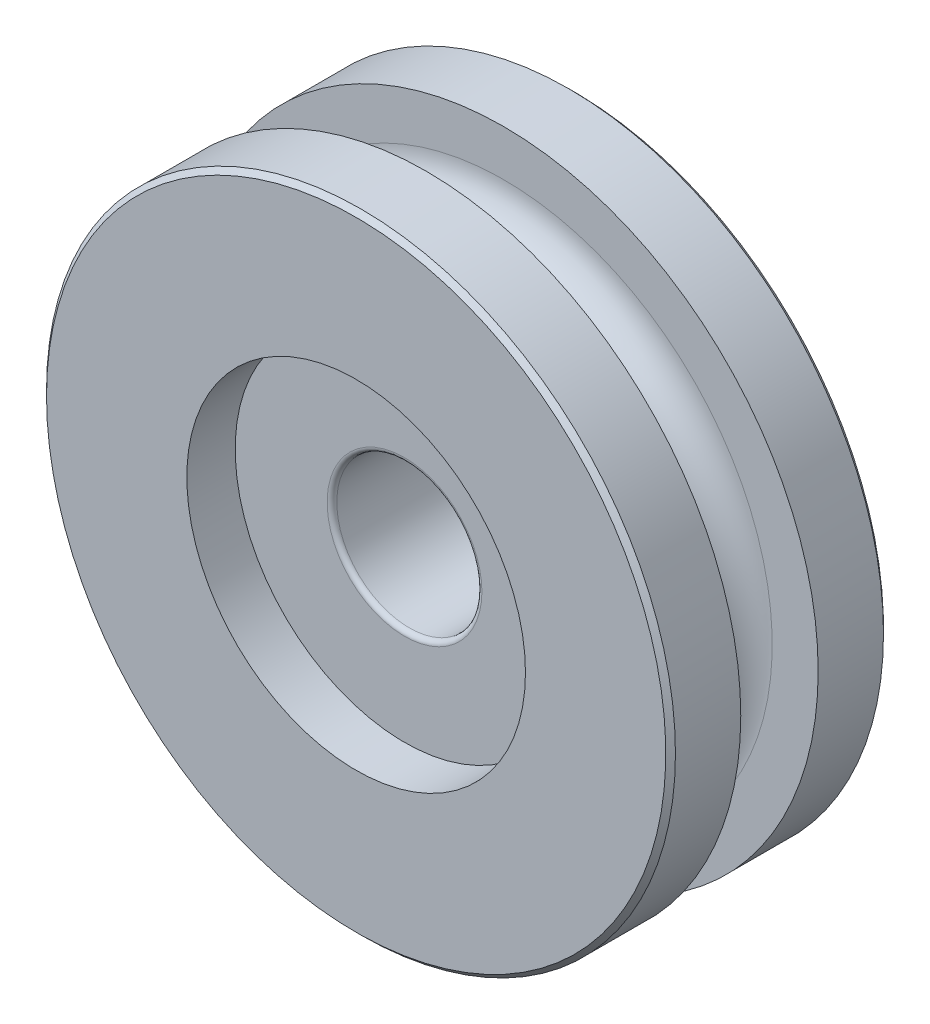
ISO-10303-21;
HEADER;
FILE_DESCRIPTION(('STEP AP214'),'2;1');
FILE_NAME('part.step','',(''),(''),'','','');
FILE_SCHEMA(('AUTOMOTIVE_DESIGN { 1 0 10303 214 1 1 1 1 }'));
ENDSEC;
DATA;
#1=APPLICATION_CONTEXT('core data for automotive mechanical design processes');
#2=APPLICATION_PROTOCOL_DEFINITION('international standard','automotive_design',2000,#1);
#3=PRODUCT_CONTEXT('',#1,'mechanical');
#4=PRODUCT('Part','Part','',(#3));
#5=PRODUCT_RELATED_PRODUCT_CATEGORY('part','',(#4));
#6=PRODUCT_DEFINITION_FORMATION('','',#4);
#7=PRODUCT_DEFINITION_CONTEXT('part definition',#1,'design');
#8=PRODUCT_DEFINITION('design','',#6,#7);
#9=PRODUCT_DEFINITION_SHAPE('','',#8);
#10=(LENGTH_UNIT() NAMED_UNIT(*) SI_UNIT(.MILLI.,.METRE.));
#11=(NAMED_UNIT(*) PLANE_ANGLE_UNIT() SI_UNIT($,.RADIAN.));
#12=(NAMED_UNIT(*) SI_UNIT($,.STERADIAN.) SOLID_ANGLE_UNIT());
#13=UNCERTAINTY_MEASURE_WITH_UNIT(LENGTH_MEASURE(1.E-05),#10,'distance_accuracy_value','');
#14=(GEOMETRIC_REPRESENTATION_CONTEXT(3) GLOBAL_UNCERTAINTY_ASSIGNED_CONTEXT((#13)) GLOBAL_UNIT_ASSIGNED_CONTEXT((#10,
#11,#12)) REPRESENTATION_CONTEXT('',''));
#15=CARTESIAN_POINT('',(0.,0.,0.));
#16=DIRECTION('',(0.,0.,1.));
#17=DIRECTION('',(1.,0.,0.));
#18=AXIS2_PLACEMENT_3D('',#15,#16,#17);
#19=CARTESIAN_POINT('',(0.,3.2,-2.5));
#20=DIRECTION('',(0.,0.,1.));
#21=DIRECTION('',(1.,0.,0.));
#22=AXIS2_PLACEMENT_3D('',#19,#20,#21);
#23=PLANE('',#22);
#24=CARTESIAN_POINT('',(-2.25,-5.66720682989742,-2.5));
#25=DIRECTION('',(0.,0.,-1.));
#26=DIRECTION('',(-1.,0.,0.));
#27=AXIS2_PLACEMENT_3D('',#24,#25,#26);
#28=CIRCLE('',#27,0.85);
#29=CARTESIAN_POINT('',(-3.1,-5.66720682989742,-2.5));
#30=VERTEX_POINT('',#29);
#31=EDGE_CURVE('E181',#30,#30,#28,.T.);
#32=ORIENTED_EDGE('',*,*,#31,.T.);
#33=EDGE_LOOP('',(#32));
#34=FACE_BOUND('',#33,.T.);
#35=ADVANCED_FACE('F14',(#34),#23,.F.);
#36=CARTESIAN_POINT('',(2.25,-5.66720682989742,-2.5));
#37=DIRECTION('',(0.,0.,1.));
#38=DIRECTION('',(-1.,0.,0.));
#39=AXIS2_PLACEMENT_3D('',#36,#37,#38);
#40=CIRCLE('',#39,0.85);
#41=CARTESIAN_POINT('',(1.4,-5.66720682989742,-2.5));
#42=VERTEX_POINT('',#41);
#43=EDGE_CURVE('E121',#42,#42,#40,.T.);
#44=ORIENTED_EDGE('',*,*,#43,.F.);
#45=EDGE_LOOP('',(#44));
#46=FACE_BOUND('',#45,.T.);
#47=ADVANCED_FACE('F268',(#46),#23,.F.);
#48=CARTESIAN_POINT('',(0.,11.1,1.6));
#49=DIRECTION('',(0.,0.,-1.));
#50=DIRECTION('',(-1.,0.,0.));
#51=AXIS2_PLACEMENT_3D('',#48,#49,#50);
#52=PLANE('',#51);
#53=CARTESIAN_POINT('',(0.,0.,1.6));
#54=DIRECTION('',(0.,0.,-1.));
#55=DIRECTION('',(-1.,0.,0.));
#56=AXIS2_PLACEMENT_3D('',#53,#54,#55);
#57=CIRCLE('',#56,13.);
#58=CARTESIAN_POINT('',(-13.,0.,1.6));
#59=VERTEX_POINT('',#58);
#60=EDGE_CURVE('E199',#59,#59,#57,.T.);
#61=ORIENTED_EDGE('',*,*,#60,.T.);
#62=EDGE_LOOP('',(#61));
#63=FACE_BOUND('',#62,.T.);
#64=CARTESIAN_POINT('',(0.,0.,1.6));
#65=DIRECTION('',(0.,0.,-1.));
#66=DIRECTION('',(-1.,0.,0.));
#67=AXIS2_PLACEMENT_3D('',#64,#65,#66);
#68=CIRCLE('',#67,11.1);
#69=CARTESIAN_POINT('',(-11.1,0.,1.6));
#70=VERTEX_POINT('',#69);
#71=EDGE_CURVE('E202',#70,#70,#68,.T.);
#72=ORIENTED_EDGE('',*,*,#71,.F.);
#73=EDGE_LOOP('',(#72));
#74=FACE_BOUND('',#73,.T.);
#75=ADVANCED_FACE('F276',(#63,#74),#52,.T.);
#76=CARTESIAN_POINT('',(0.,0.,-6.27375485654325));
#77=DIRECTION('',(0.,0.,-1.));
#78=DIRECTION('',(-1.,0.,0.));
#79=AXIS2_PLACEMENT_3D('',#76,#77,#78);
#80=CYLINDRICAL_SURFACE('',#79,13.);
#81=CARTESIAN_POINT('',(0.,0.,4.3));
#82=DIRECTION('',(0.,0.,-1.));
#83=DIRECTION('',(-1.,0.,0.));
#84=AXIS2_PLACEMENT_3D('',#81,#82,#83);
#85=CIRCLE('',#84,13.);
#86=CARTESIAN_POINT('',(-13.,0.,4.3));
#87=VERTEX_POINT('',#86);
#88=EDGE_CURVE('E196',#87,#87,#85,.T.);
#89=ORIENTED_EDGE('',*,*,#88,.T.);
#90=EDGE_LOOP('',(#89));
#91=FACE_BOUND('',#90,.T.);
#92=ORIENTED_EDGE('',*,*,#60,.F.);
#93=EDGE_LOOP('',(#92));
#94=FACE_BOUND('',#93,.T.);
#95=ADVANCED_FACE('F326',(#91,#94),#80,.T.);
#96=CARTESIAN_POINT('',(0.,0.,0.));
#97=DIRECTION('',(0.,0.,-1.));
#98=DIRECTION('',(-1.,0.,0.));
#99=AXIS2_PLACEMENT_3D('',#96,#97,#98);
#100=TOROIDAL_SURFACE('',#99,11.1,1.6);
#101=ORIENTED_EDGE('',*,*,#71,.T.);
#102=EDGE_LOOP('',(#101));
#103=FACE_BOUND('',#102,.T.);
#104=CARTESIAN_POINT('',(0.,0.,-1.6));
#105=DIRECTION('',(0.,0.,-1.));
#106=DIRECTION('',(-1.,0.,0.));
#107=AXIS2_PLACEMENT_3D('',#104,#105,#106);
#108=CIRCLE('',#107,11.1);
#109=CARTESIAN_POINT('',(-11.1,0.,-1.6));
#110=VERTEX_POINT('',#109);
#111=EDGE_CURVE('E205',#110,#110,#108,.T.);
#112=ORIENTED_EDGE('',*,*,#111,.F.);
#113=EDGE_LOOP('',(#112));
#114=FACE_BOUND('',#113,.T.);
#115=ADVANCED_FACE('F324',(#103,#114),#100,.F.);
#116=CARTESIAN_POINT('',(0.,0.,4.3));
#117=DIRECTION('',(0.,0.,-1.));
#118=DIRECTION('',(-1.,0.,0.));
#119=AXIS2_PLACEMENT_3D('',#116,#117,#118);
#120=CONICAL_SURFACE('',#119,13.,0.785398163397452);
#121=CARTESIAN_POINT('',(0.,0.,4.5));
#122=DIRECTION('',(0.,0.,-1.));
#123=DIRECTION('',(-1.,0.,0.));
#124=AXIS2_PLACEMENT_3D('',#121,#122,#123);
#125=CIRCLE('',#124,12.8);
#126=CARTESIAN_POINT('',(-12.8,0.,4.5));
#127=VERTEX_POINT('',#126);
#128=EDGE_CURVE('E193',#127,#127,#125,.T.);
#129=ORIENTED_EDGE('',*,*,#128,.T.);
#130=EDGE_LOOP('',(#129));
#131=FACE_BOUND('',#130,.T.);
#132=ORIENTED_EDGE('',*,*,#88,.F.);
#133=EDGE_LOOP('',(#132));
#134=FACE_BOUND('',#133,.T.);
#135=ADVANCED_FACE('F320',(#131,#134),#120,.T.);
#136=CARTESIAN_POINT('',(0.,11.1,-1.6));
#137=DIRECTION('',(0.,0.,1.));
#138=DIRECTION('',(1.,0.,0.));
#139=AXIS2_PLACEMENT_3D('',#136,#137,#138);
#140=PLANE('',#139);
#141=ORIENTED_EDGE('',*,*,#111,.T.);
#142=EDGE_LOOP('',(#141));
#143=FACE_BOUND('',#142,.T.);
#144=CARTESIAN_POINT('',(0.,0.,-1.6));
#145=DIRECTION('',(0.,0.,-1.));
#146=DIRECTION('',(-1.,0.,0.));
#147=AXIS2_PLACEMENT_3D('',#144,#145,#146);
#148=CIRCLE('',#147,13.);
#149=CARTESIAN_POINT('',(-13.,0.,-1.6));
#150=VERTEX_POINT('',#149);
#151=EDGE_CURVE('E208',#150,#150,#148,.T.);
#152=ORIENTED_EDGE('',*,*,#151,.F.);
#153=EDGE_LOOP('',(#152));
#154=FACE_BOUND('',#153,.T.);
#155=ADVANCED_FACE('F323',(#143,#154),#140,.T.);
#156=CARTESIAN_POINT('',(0.,0.,4.5));
#157=DIRECTION('',(0.,0.,1.));
#158=DIRECTION('',(1.,0.,0.));
#159=AXIS2_PLACEMENT_3D('',#156,#157,#158);
#160=PLANE('',#159);
#161=ORIENTED_EDGE('',*,*,#128,.F.);
#162=EDGE_LOOP('',(#161));
#163=FACE_BOUND('',#162,.T.);
#164=CARTESIAN_POINT('',(0.,0.,4.5));
#165=DIRECTION('',(0.,0.,1.));
#166=DIRECTION('',(1.,0.,0.));
#167=AXIS2_PLACEMENT_3D('',#164,#165,#166);
#168=CIRCLE('',#167,7.);
#169=CARTESIAN_POINT('',(7.,0.,4.5));
#170=VERTEX_POINT('',#169);
#171=EDGE_CURVE('E226',#170,#170,#168,.T.);
#172=ORIENTED_EDGE('',*,*,#171,.F.);
#173=EDGE_LOOP('',(#172));
#174=FACE_BOUND('',#173,.T.);
#175=ADVANCED_FACE('F338',(#163,#174),#160,.T.);
#176=CARTESIAN_POINT('',(0.,0.,-6.27375485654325));
#177=DIRECTION('',(0.,0.,-1.));
#178=DIRECTION('',(-1.,0.,0.));
#179=AXIS2_PLACEMENT_3D('',#176,#177,#178);
#180=CYLINDRICAL_SURFACE('',#179,13.);
#181=ORIENTED_EDGE('',*,*,#151,.T.);
#182=EDGE_LOOP('',(#181));
#183=FACE_BOUND('',#182,.T.);
#184=CARTESIAN_POINT('',(0.,0.,-4.3));
#185=DIRECTION('',(0.,0.,-1.));
#186=DIRECTION('',(-1.,0.,0.));
#187=AXIS2_PLACEMENT_3D('',#184,#185,#186);
#188=CIRCLE('',#187,13.);
#189=CARTESIAN_POINT('',(-13.,0.,-4.3));
#190=VERTEX_POINT('',#189);
#191=EDGE_CURVE('E211',#190,#190,#188,.T.);
#192=ORIENTED_EDGE('',*,*,#191,.F.);
#193=EDGE_LOOP('',(#192));
#194=FACE_BOUND('',#193,.T.);
#195=ADVANCED_FACE('F340',(#183,#194),#180,.T.);
#196=CARTESIAN_POINT('',(0.,0.,6.));
#197=DIRECTION('',(0.,0.,1.));
#198=DIRECTION('',(1.,0.,0.));
#199=AXIS2_PLACEMENT_3D('',#196,#197,#198);
#200=CYLINDRICAL_SURFACE('',#199,7.);
#201=CARTESIAN_POINT('',(0.,0.,2.5));
#202=DIRECTION('',(0.,0.,1.));
#203=DIRECTION('',(1.,0.,0.));
#204=AXIS2_PLACEMENT_3D('',#201,#202,#203);
#205=CIRCLE('',#204,7.);
#206=CARTESIAN_POINT('',(7.,0.,2.5));
#207=VERTEX_POINT('',#206);
#208=EDGE_CURVE('E232',#207,#207,#205,.T.);
#209=ORIENTED_EDGE('',*,*,#208,.F.);
#210=EDGE_LOOP('',(#209));
#211=FACE_BOUND('',#210,.T.);
#212=ORIENTED_EDGE('',*,*,#171,.T.);
#213=EDGE_LOOP('',(#212));
#214=FACE_BOUND('',#213,.T.);
#215=ADVANCED_FACE('F342',(#211,#214),#200,.F.);
#216=CARTESIAN_POINT('',(0.,0.,-4.5));
#217=DIRECTION('',(0.,0.,1.));
#218=DIRECTION('',(1.,0.,0.));
#219=AXIS2_PLACEMENT_3D('',#216,#217,#218);
#220=CONICAL_SURFACE('',#219,12.8,0.78539816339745);
#221=ORIENTED_EDGE('',*,*,#191,.T.);
#222=EDGE_LOOP('',(#221));
#223=FACE_BOUND('',#222,.T.);
#224=CARTESIAN_POINT('',(0.,0.,-4.5));
#225=DIRECTION('',(0.,0.,-1.));
#226=DIRECTION('',(-1.,0.,0.));
#227=AXIS2_PLACEMENT_3D('',#224,#225,#226);
#228=CIRCLE('',#227,12.8);
#229=CARTESIAN_POINT('',(-12.8,0.,-4.5));
#230=VERTEX_POINT('',#229);
#231=EDGE_CURVE('E214',#230,#230,#228,.T.);
#232=ORIENTED_EDGE('',*,*,#231,.F.);
#233=EDGE_LOOP('',(#232));
#234=FACE_BOUND('',#233,.T.);
#235=ADVANCED_FACE('F344',(#223,#234),#220,.T.);
#236=CARTESIAN_POINT('',(0.,3.2,2.5));
#237=DIRECTION('',(0.,0.,-1.));
#238=DIRECTION('',(-1.,0.,0.));
#239=AXIS2_PLACEMENT_3D('',#236,#237,#238);
#240=PLANE('',#239);
#241=CARTESIAN_POINT('',(0.,0.,2.5));
#242=DIRECTION('',(0.,0.,1.));
#243=DIRECTION('',(1.,0.,0.));
#244=AXIS2_PLACEMENT_3D('',#241,#242,#243);
#245=CIRCLE('',#244,3.2);
#246=CARTESIAN_POINT('',(3.2,0.,2.5));
#247=VERTEX_POINT('',#246);
#248=EDGE_CURVE('E229',#247,#247,#245,.T.);
#249=ORIENTED_EDGE('',*,*,#248,.F.);
#250=EDGE_LOOP('',(#249));
#251=FACE_BOUND('',#250,.T.);
#252=ORIENTED_EDGE('',*,*,#208,.T.);
#253=EDGE_LOOP('',(#252));
#254=FACE_BOUND('',#253,.T.);
#255=ADVANCED_FACE('F346',(#251,#254),#240,.F.);
#256=CARTESIAN_POINT('',(0.,0.,-4.5));
#257=DIRECTION('',(0.,0.,-1.));
#258=DIRECTION('',(-1.,0.,0.));
#259=AXIS2_PLACEMENT_3D('',#256,#257,#258);
#260=PLANE('',#259);
#261=ORIENTED_EDGE('',*,*,#231,.T.);
#262=EDGE_LOOP('',(#261));
#263=FACE_BOUND('',#262,.T.);
#264=CARTESIAN_POINT('',(0.,0.,-4.5));
#265=DIRECTION('',(0.,0.,-1.));
#266=DIRECTION('',(-1.,0.,0.));
#267=AXIS2_PLACEMENT_3D('',#264,#265,#266);
#268=CIRCLE('',#267,7.5);
#269=CARTESIAN_POINT('',(-7.5,0.,-4.5));
#270=VERTEX_POINT('',#269);
#271=EDGE_CURVE('E223',#270,#270,#268,.T.);
#272=ORIENTED_EDGE('',*,*,#271,.F.);
#273=EDGE_LOOP('',(#272));
#274=FACE_BOUND('',#273,.T.);
#275=ADVANCED_FACE('F353',(#263,#274),#260,.T.);
#276=CARTESIAN_POINT('',(0.,0.,2.3));
#277=DIRECTION('',(0.,0.,1.));
#278=DIRECTION('',(1.,0.,0.));
#279=AXIS2_PLACEMENT_3D('',#276,#277,#278);
#280=TOROIDAL_SURFACE('',#279,3.2,0.200000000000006);
#281=CARTESIAN_POINT('',(0.,0.,2.3));
#282=DIRECTION('',(0.,0.,1.));
#283=DIRECTION('',(1.,0.,0.));
#284=AXIS2_PLACEMENT_3D('',#281,#282,#283);
#285=CIRCLE('',#284,3.);
#286=CARTESIAN_POINT('',(3.,0.,2.3));
#287=VERTEX_POINT('',#286);
#288=EDGE_CURVE('E173',#287,#287,#285,.T.);
#289=ORIENTED_EDGE('',*,*,#288,.F.);
#290=EDGE_LOOP('',(#289));
#291=FACE_BOUND('',#290,.T.);
#292=ORIENTED_EDGE('',*,*,#248,.T.);
#293=EDGE_LOOP('',(#292));
#294=FACE_BOUND('',#293,.T.);
#295=ADVANCED_FACE('F16',(#291,#294),#280,.T.);
#296=CARTESIAN_POINT('',(0.,0.,18.7132034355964));
#297=DIRECTION('',(0.,0.,-1.));
#298=DIRECTION('',(-1.,0.,0.));
#299=AXIS2_PLACEMENT_3D('',#296,#297,#298);
#300=CYLINDRICAL_SURFACE('',#299,7.5);
#301=CARTESIAN_POINT('',(0.,0.,-3.65));
#302=DIRECTION('',(0.,0.,-1.));
#303=DIRECTION('',(-1.,0.,0.));
#304=AXIS2_PLACEMENT_3D('',#301,#302,#303);
#305=CIRCLE('',#304,7.5);
#306=CARTESIAN_POINT('',(-7.5,0.,-3.65));
#307=VERTEX_POINT('',#306);
#308=EDGE_CURVE('E221',#307,#307,#305,.F.);
#309=ORIENTED_EDGE('',*,*,#308,.T.);
#310=EDGE_LOOP('',(#309));
#311=FACE_BOUND('',#310,.T.);
#312=ORIENTED_EDGE('',*,*,#271,.T.);
#313=EDGE_LOOP('',(#312));
#314=FACE_BOUND('',#313,.T.);
#315=ADVANCED_FACE('F246',(#311,#314),#300,.F.);
#316=CARTESIAN_POINT('',(0.,0.,6.));
#317=DIRECTION('',(0.,0.,1.));
#318=DIRECTION('',(1.,0.,0.));
#319=AXIS2_PLACEMENT_3D('',#316,#317,#318);
#320=CYLINDRICAL_SURFACE('',#319,3.);
#321=CARTESIAN_POINT('',(0.,0.,-2.3));
#322=DIRECTION('',(0.,0.,1.));
#323=DIRECTION('',(1.,0.,0.));
#324=AXIS2_PLACEMENT_3D('',#321,#322,#323);
#325=CIRCLE('',#324,3.);
#326=CARTESIAN_POINT('',(3.,0.,-2.3));
#327=VERTEX_POINT('',#326);
#328=EDGE_CURVE('E238',#327,#327,#325,.T.);
#329=ORIENTED_EDGE('',*,*,#328,.F.);
#330=EDGE_LOOP('',(#329));
#331=FACE_BOUND('',#330,.T.);
#332=ORIENTED_EDGE('',*,*,#288,.T.);
#333=EDGE_LOOP('',(#332));
#334=FACE_BOUND('',#333,.T.);
#335=ADVANCED_FACE('F252',(#331,#334),#320,.F.);
#336=CARTESIAN_POINT('',(0.,0.,-3.65));
#337=DIRECTION('',(0.,0.,-1.));
#338=DIRECTION('',(-1.,0.,0.));
#339=AXIS2_PLACEMENT_3D('',#336,#337,#338);
#340=PLANE('',#339);
#341=CARTESIAN_POINT('',(0.,0.,-3.65));
#342=DIRECTION('',(0.,0.,-1.));
#343=DIRECTION('',(-1.,0.,0.));
#344=AXIS2_PLACEMENT_3D('',#341,#342,#343);
#345=CIRCLE('',#344,7.85);
#346=CARTESIAN_POINT('',(-7.85,0.,-3.65));
#347=VERTEX_POINT('',#346);
#348=EDGE_CURVE('E218',#347,#347,#345,.T.);
#349=ORIENTED_EDGE('',*,*,#348,.F.);
#350=EDGE_LOOP('',(#349));
#351=FACE_BOUND('',#350,.T.);
#352=ORIENTED_EDGE('',*,*,#308,.F.);
#353=EDGE_LOOP('',(#352));
#354=FACE_BOUND('',#353,.T.);
#355=ADVANCED_FACE('F249',(#351,#354),#340,.F.);
#356=CARTESIAN_POINT('',(0.,0.,-3.65));
#357=DIRECTION('',(0.,0.,1.));
#358=DIRECTION('',(1.,0.,0.));
#359=AXIS2_PLACEMENT_3D('',#356,#357,#358);
#360=CYLINDRICAL_SURFACE('',#359,7.85);
#361=ORIENTED_EDGE('',*,*,#348,.T.);
#362=EDGE_LOOP('',(#361));
#363=FACE_BOUND('',#362,.T.);
#364=DIRECTION('',(0.,0.,1.));
#365=VECTOR('',#364,1.);
#366=CARTESIAN_POINT('',(-1.40277147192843,-7.72364759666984,-3.65));
#367=LINE('',#366,#365);
#368=CARTESIAN_POINT('',(-1.40277147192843,-7.72364759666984,-2.5));
#369=VERTEX_POINT('',#368);
#370=CARTESIAN_POINT('',(-1.40277147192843,-7.72364759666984,-3.5));
#371=VERTEX_POINT('',#370);
#372=EDGE_CURVE('E18',#369,#371,#367,.F.);
#373=ORIENTED_EDGE('',*,*,#372,.F.);
#374=CARTESIAN_POINT('',(0.,0.,-2.5));
#375=DIRECTION('',(0.,0.,-1.));
#376=DIRECTION('',(-1.,0.,0.));
#377=AXIS2_PLACEMENT_3D('',#374,#375,#376);
#378=CIRCLE('',#377,7.85);
#379=CARTESIAN_POINT('',(1.40277147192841,-7.72364759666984,-2.5));
#380=VERTEX_POINT('',#379);
#381=EDGE_CURVE('E217',#380,#369,#378,.T.);
#382=ORIENTED_EDGE('',*,*,#381,.F.);
#383=DIRECTION('',(0.,0.,1.));
#384=VECTOR('',#383,1.);
#385=CARTESIAN_POINT('',(1.40277147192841,-7.72364759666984,-3.65));
#386=LINE('',#385,#384);
#387=CARTESIAN_POINT('',(1.40277147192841,-7.72364759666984,-3.5));
#388=VERTEX_POINT('',#387);
#389=EDGE_CURVE('E99',#388,#380,#386,.T.);
#390=ORIENTED_EDGE('',*,*,#389,.F.);
#391=CARTESIAN_POINT('',(0.,0.,-3.5));
#392=DIRECTION('',(0.,0.,1.));
#393=DIRECTION('',(1.,0.,0.));
#394=AXIS2_PLACEMENT_3D('',#391,#392,#393);
#395=CIRCLE('',#394,7.85);
#396=EDGE_CURVE('E9',#371,#388,#395,.F.);
#397=ORIENTED_EDGE('',*,*,#396,.F.);
#398=EDGE_LOOP('',(#373,#382,#390,#397));
#399=FACE_BOUND('',#398,.T.);
#400=ADVANCED_FACE('F251',(#363,#399),#360,.F.);
#401=CARTESIAN_POINT('',(0.,0.,-2.3));
#402=DIRECTION('',(0.,0.,1.));
#403=DIRECTION('',(1.,0.,0.));
#404=AXIS2_PLACEMENT_3D('',#401,#402,#403);
#405=TOROIDAL_SURFACE('',#404,3.2,0.200000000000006);
#406=CARTESIAN_POINT('',(0.,0.,-2.5));
#407=DIRECTION('',(0.,0.,1.));
#408=DIRECTION('',(1.,0.,0.));
#409=AXIS2_PLACEMENT_3D('',#406,#407,#408);
#410=CIRCLE('',#409,3.2);
#411=CARTESIAN_POINT('',(3.2,0.,-2.5));
#412=VERTEX_POINT('',#411);
#413=EDGE_CURVE('E235',#412,#412,#410,.T.);
#414=ORIENTED_EDGE('',*,*,#413,.F.);
#415=EDGE_LOOP('',(#414));
#416=FACE_BOUND('',#415,.T.);
#417=ORIENTED_EDGE('',*,*,#328,.T.);
#418=EDGE_LOOP('',(#417));
#419=FACE_BOUND('',#418,.T.);
#420=ADVANCED_FACE('F261',(#416,#419),#405,.T.);
#421=ORIENTED_EDGE('',*,*,#413,.T.);
#422=EDGE_LOOP('',(#421));
#423=FACE_BOUND('',#422,.T.);
#424=ORIENTED_EDGE('',*,*,#381,.T.);
#425=DIRECTION('',(-0.231349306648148,-0.972870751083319,0.));
#426=VECTOR('',#425,1.);
#427=CARTESIAN_POINT('',(-0.985268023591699,-5.96796092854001,-2.5));
#428=LINE('',#427,#426);
#429=CARTESIAN_POINT('',(-0.985268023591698,-5.96796092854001,-2.5));
#430=VERTEX_POINT('',#429);
#431=EDGE_CURVE('E34',#430,#369,#428,.T.);
#432=ORIENTED_EDGE('',*,*,#431,.F.);
#433=CARTESIAN_POINT('',(-2.25,-5.66720682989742,-2.5));
#434=DIRECTION('',(0.,0.,-1.));
#435=DIRECTION('',(-1.,0.,0.));
#436=AXIS2_PLACEMENT_3D('',#433,#434,#435);
#437=CIRCLE('',#436,1.3);
#438=CARTESIAN_POINT('',(-2.87276702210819,-4.52608403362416,-2.5));
#439=VERTEX_POINT('',#438);
#440=EDGE_CURVE('E155',#439,#430,#437,.T.);
#441=ORIENTED_EDGE('',*,*,#440,.F.);
#442=DIRECTION('',(0.877786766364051,0.479051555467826,0.));
#443=VECTOR('',#442,1.);
#444=CARTESIAN_POINT('',(-2.87276702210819,-4.52608403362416,-2.5));
#445=LINE('',#444,#443);
#446=CARTESIAN_POINT('',(-4.44128996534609,-5.38210440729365,-2.5));
#447=VERTEX_POINT('',#446);
#448=EDGE_CURVE('E150',#447,#439,#445,.T.);
#449=ORIENTED_EDGE('',*,*,#448,.F.);
#450=CARTESIAN_POINT('',(0.,-0.499999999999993,-2.5));
#451=DIRECTION('',(0.,0.,1.));
#452=DIRECTION('',(0.,-1.,0.));
#453=AXIS2_PLACEMENT_3D('',#450,#451,#452);
#454=CIRCLE('',#453,6.6);
#455=CARTESIAN_POINT('',(4.44128996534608,-5.38210440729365,-2.5));
#456=VERTEX_POINT('',#455);
#457=EDGE_CURVE('E149',#456,#447,#454,.T.);
#458=ORIENTED_EDGE('',*,*,#457,.F.);
#459=DIRECTION('',(0.87778676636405,-0.479051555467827,0.));
#460=VECTOR('',#459,1.);
#461=CARTESIAN_POINT('',(2.87276702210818,-4.52608403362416,-2.5));
#462=LINE('',#461,#460);
#463=CARTESIAN_POINT('',(2.87276702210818,-4.52608403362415,-2.5));
#464=VERTEX_POINT('',#463);
#465=EDGE_CURVE('E110',#464,#456,#462,.T.);
#466=ORIENTED_EDGE('',*,*,#465,.F.);
#467=CARTESIAN_POINT('',(2.25,-5.66720682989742,-2.5));
#468=DIRECTION('',(0.,0.,-1.));
#469=DIRECTION('',(1.,0.,0.));
#470=AXIS2_PLACEMENT_3D('',#467,#468,#469);
#471=CIRCLE('',#470,1.3);
#472=CARTESIAN_POINT('',(0.98526802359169,-5.96796092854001,-2.5));
#473=VERTEX_POINT('',#472);
#474=EDGE_CURVE('E105',#473,#464,#471,.T.);
#475=ORIENTED_EDGE('',*,*,#474,.F.);
#476=DIRECTION('',(-0.231349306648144,0.97287075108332,0.));
#477=VECTOR('',#476,1.);
#478=CARTESIAN_POINT('',(0.98526802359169,-5.96796092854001,-2.5));
#479=LINE('',#478,#477);
#480=EDGE_CURVE('E93',#380,#473,#479,.T.);
#481=ORIENTED_EDGE('',*,*,#480,.F.);
#482=EDGE_LOOP('',(#424,#432,#441,#449,#458,#466,#475,#481));
#483=FACE_BOUND('',#482,.T.);
#484=ADVANCED_FACE('F108',(#423,#483),#23,.F.);
#485=CARTESIAN_POINT('',(0.,-0.499999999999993,-3.5));
#486=DIRECTION('',(0.,0.,-1.));
#487=DIRECTION('',(1.,0.,0.));
#488=AXIS2_PLACEMENT_3D('',#485,#486,#487);
#489=CYLINDRICAL_SURFACE('',#488,6.6);
#490=ORIENTED_EDGE('',*,*,#457,.T.);
#491=DIRECTION('',(0.,0.,1.));
#492=VECTOR('',#491,1.);
#493=CARTESIAN_POINT('',(-4.44128996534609,-5.38210440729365,-3.5));
#494=LINE('',#493,#492);
#495=CARTESIAN_POINT('',(-4.44128996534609,-5.38210440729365,-3.5));
#496=VERTEX_POINT('',#495);
#497=EDGE_CURVE('E163',#496,#447,#494,.T.);
#498=ORIENTED_EDGE('',*,*,#497,.F.);
#499=CARTESIAN_POINT('',(0.,-0.499999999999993,-3.5));
#500=DIRECTION('',(0.,0.,1.));
#501=DIRECTION('',(0.,-1.,0.));
#502=AXIS2_PLACEMENT_3D('',#499,#500,#501);
#503=CIRCLE('',#502,6.6);
#504=CARTESIAN_POINT('',(4.44128996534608,-5.38210440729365,-3.5));
#505=VERTEX_POINT('',#504);
#506=EDGE_CURVE('E135',#505,#496,#503,.T.);
#507=ORIENTED_EDGE('',*,*,#506,.F.);
#508=DIRECTION('',(0.,0.,1.));
#509=VECTOR('',#508,1.);
#510=CARTESIAN_POINT('',(4.44128996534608,-5.38210440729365,-3.5));
#511=LINE('',#510,#509);
#512=EDGE_CURVE('E145',#505,#456,#511,.T.);
#513=ORIENTED_EDGE('',*,*,#512,.T.);
#514=EDGE_LOOP('',(#490,#498,#507,#513));
#515=FACE_BOUND('',#514,.T.);
#516=ADVANCED_FACE('F271',(#515),#489,.F.);
#517=CARTESIAN_POINT('',(-2.87276702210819,-4.52608403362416,-3.5));
#518=DIRECTION('',(0.479051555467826,-0.877786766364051,0.));
#519=DIRECTION('',(0.877786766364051,0.479051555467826,0.));
#520=AXIS2_PLACEMENT_3D('',#517,#518,#519);
#521=PLANE('',#520);
#522=ORIENTED_EDGE('',*,*,#448,.T.);
#523=DIRECTION('',(0.,0.,1.));
#524=VECTOR('',#523,1.);
#525=CARTESIAN_POINT('',(-2.87276702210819,-4.52608403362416,-3.5));
#526=LINE('',#525,#524);
#527=CARTESIAN_POINT('',(-2.87276702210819,-4.52608403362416,-3.5));
#528=VERTEX_POINT('',#527);
#529=EDGE_CURVE('E151',#528,#439,#526,.T.);
#530=ORIENTED_EDGE('',*,*,#529,.F.);
#531=DIRECTION('',(0.877786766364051,0.479051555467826,0.));
#532=VECTOR('',#531,1.);
#533=CARTESIAN_POINT('',(-2.87276702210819,-4.52608403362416,-3.5));
#534=LINE('',#533,#532);
#535=EDGE_CURVE('E132',#496,#528,#534,.T.);
#536=ORIENTED_EDGE('',*,*,#535,.F.);
#537=ORIENTED_EDGE('',*,*,#497,.T.);
#538=EDGE_LOOP('',(#522,#530,#536,#537));
#539=FACE_BOUND('',#538,.T.);
#540=ADVANCED_FACE('F284',(#539),#521,.F.);
#541=CARTESIAN_POINT('',(-2.25,-5.66720682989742,-3.5));
#542=DIRECTION('',(0.,0.,-1.));
#543=DIRECTION('',(1.,0.,0.));
#544=AXIS2_PLACEMENT_3D('',#541,#542,#543);
#545=CYLINDRICAL_SURFACE('',#544,1.3);
#546=ORIENTED_EDGE('',*,*,#440,.T.);
#547=DIRECTION('',(0.,0.,1.));
#548=VECTOR('',#547,1.);
#549=CARTESIAN_POINT('',(-0.985268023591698,-5.96796092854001,-3.5));
#550=LINE('',#549,#548);
#551=CARTESIAN_POINT('',(-0.985268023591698,-5.96796092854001,-3.5));
#552=VERTEX_POINT('',#551);
#553=EDGE_CURVE('E104',#552,#430,#550,.T.);
#554=ORIENTED_EDGE('',*,*,#553,.F.);
#555=CARTESIAN_POINT('',(-2.25,-5.66720682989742,-3.5));
#556=DIRECTION('',(0.,0.,-1.));
#557=DIRECTION('',(-1.,0.,0.));
#558=AXIS2_PLACEMENT_3D('',#555,#556,#557);
#559=CIRCLE('',#558,1.3);
#560=EDGE_CURVE('E136',#528,#552,#559,.T.);
#561=ORIENTED_EDGE('',*,*,#560,.F.);
#562=ORIENTED_EDGE('',*,*,#529,.T.);
#563=EDGE_LOOP('',(#546,#554,#561,#562));
#564=FACE_BOUND('',#563,.T.);
#565=ADVANCED_FACE('F291',(#564),#545,.T.);
#566=CARTESIAN_POINT('',(0.98526802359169,-5.96796092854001,-3.5));
#567=DIRECTION('',(0.97287075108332,0.231349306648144,0.));
#568=DIRECTION('',(0.,0.,-1.));
#569=AXIS2_PLACEMENT_3D('',#566,#567,#568);
#570=PLANE('',#569);
#571=DIRECTION('',(-0.231349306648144,0.97287075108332,0.));
#572=VECTOR('',#571,1.);
#573=CARTESIAN_POINT('',(0.98526802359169,-5.96796092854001,-3.5));
#574=LINE('',#573,#572);
#575=CARTESIAN_POINT('',(0.98526802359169,-5.96796092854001,-3.5));
#576=VERTEX_POINT('',#575);
#577=EDGE_CURVE('E144',#388,#576,#574,.T.);
#578=ORIENTED_EDGE('',*,*,#577,.F.);
#579=ORIENTED_EDGE('',*,*,#389,.T.);
#580=ORIENTED_EDGE('',*,*,#480,.T.);
#581=DIRECTION('',(0.,0.,1.));
#582=VECTOR('',#581,1.);
#583=CARTESIAN_POINT('',(0.98526802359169,-5.96796092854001,-3.5));
#584=LINE('',#583,#582);
#585=EDGE_CURVE('E98',#576,#473,#584,.T.);
#586=ORIENTED_EDGE('',*,*,#585,.F.);
#587=EDGE_LOOP('',(#578,#579,#580,#586));
#588=FACE_BOUND('',#587,.T.);
#589=ADVANCED_FACE('F96',(#588),#570,.F.);
#590=CARTESIAN_POINT('',(0.,-0.499999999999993,-3.5));
#591=DIRECTION('',(0.,0.,1.));
#592=DIRECTION('',(0.,-1.,0.));
#593=AXIS2_PLACEMENT_3D('',#590,#591,#592);
#594=PLANE('',#593);
#595=CARTESIAN_POINT('',(2.25,-5.66720682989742,-3.5));
#596=DIRECTION('',(0.,0.,1.));
#597=DIRECTION('',(-1.,0.,0.));
#598=AXIS2_PLACEMENT_3D('',#595,#596,#597);
#599=CIRCLE('',#598,0.85);
#600=CARTESIAN_POINT('',(1.4,-5.66720682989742,-3.5));
#601=VERTEX_POINT('',#600);
#602=EDGE_CURVE('E166',#601,#601,#599,.T.);
#603=ORIENTED_EDGE('',*,*,#602,.T.);
#604=EDGE_LOOP('',(#603));
#605=FACE_BOUND('',#604,.T.);
#606=CARTESIAN_POINT('',(-2.25,-5.66720682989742,-3.5));
#607=DIRECTION('',(0.,0.,-1.));
#608=DIRECTION('',(-1.,0.,0.));
#609=AXIS2_PLACEMENT_3D('',#606,#607,#608);
#610=CIRCLE('',#609,0.85);
#611=CARTESIAN_POINT('',(-3.1,-5.66720682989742,-3.5));
#612=VERTEX_POINT('',#611);
#613=EDGE_CURVE('E128',#612,#612,#610,.T.);
#614=ORIENTED_EDGE('',*,*,#613,.F.);
#615=EDGE_LOOP('',(#614));
#616=FACE_BOUND('',#615,.T.);
#617=DIRECTION('',(-0.231349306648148,-0.972870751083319,0.));
#618=VECTOR('',#617,1.);
#619=CARTESIAN_POINT('',(-0.985268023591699,-5.96796092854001,-3.5));
#620=LINE('',#619,#618);
#621=EDGE_CURVE('E140',#552,#371,#620,.T.);
#622=ORIENTED_EDGE('',*,*,#621,.T.);
#623=ORIENTED_EDGE('',*,*,#396,.T.);
#624=ORIENTED_EDGE('',*,*,#577,.T.);
#625=CARTESIAN_POINT('',(2.25,-5.66720682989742,-3.5));
#626=DIRECTION('',(0.,0.,-1.));
#627=DIRECTION('',(1.,0.,0.));
#628=AXIS2_PLACEMENT_3D('',#625,#626,#627);
#629=CIRCLE('',#628,1.3);
#630=CARTESIAN_POINT('',(2.87276702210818,-4.52608403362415,-3.5));
#631=VERTEX_POINT('',#630);
#632=EDGE_CURVE('E119',#576,#631,#629,.T.);
#633=ORIENTED_EDGE('',*,*,#632,.T.);
#634=DIRECTION('',(0.87778676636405,-0.479051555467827,0.));
#635=VECTOR('',#634,1.);
#636=CARTESIAN_POINT('',(2.87276702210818,-4.52608403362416,-3.5));
#637=LINE('',#636,#635);
#638=EDGE_CURVE('E160',#631,#505,#637,.T.);
#639=ORIENTED_EDGE('',*,*,#638,.T.);
#640=ORIENTED_EDGE('',*,*,#506,.T.);
#641=ORIENTED_EDGE('',*,*,#535,.T.);
#642=ORIENTED_EDGE('',*,*,#560,.T.);
#643=EDGE_LOOP('',(#622,#623,#624,#633,#639,#640,#641,#642));
#644=FACE_BOUND('',#643,.T.);
#645=ADVANCED_FACE('F305',(#605,#616,#644),#594,.F.);
#646=CARTESIAN_POINT('',(-2.25,-5.66720682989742,-3.5));
#647=DIRECTION('',(0.,0.,-1.));
#648=DIRECTION('',(1.,0.,0.));
#649=AXIS2_PLACEMENT_3D('',#646,#647,#648);
#650=CYLINDRICAL_SURFACE('',#649,0.85);
#651=ORIENTED_EDGE('',*,*,#31,.F.);
#652=EDGE_LOOP('',(#651));
#653=FACE_BOUND('',#652,.T.);
#654=ORIENTED_EDGE('',*,*,#613,.T.);
#655=EDGE_LOOP('',(#654));
#656=FACE_BOUND('',#655,.T.);
#657=ADVANCED_FACE('F308',(#653,#656),#650,.F.);
#658=CARTESIAN_POINT('',(2.25,-5.66720682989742,-3.5));
#659=DIRECTION('',(0.,0.,-1.));
#660=DIRECTION('',(1.,0.,0.));
#661=AXIS2_PLACEMENT_3D('',#658,#659,#660);
#662=CYLINDRICAL_SURFACE('',#661,0.85);
#663=ORIENTED_EDGE('',*,*,#43,.T.);
#664=EDGE_LOOP('',(#663));
#665=FACE_BOUND('',#664,.T.);
#666=ORIENTED_EDGE('',*,*,#602,.F.);
#667=EDGE_LOOP('',(#666));
#668=FACE_BOUND('',#667,.T.);
#669=ADVANCED_FACE('F301',(#665,#668),#662,.F.);
#670=CARTESIAN_POINT('',(2.87276702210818,-4.52608403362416,-3.5));
#671=DIRECTION('',(-0.479051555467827,-0.87778676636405,0.));
#672=DIRECTION('',(0.,0.,1.));
#673=AXIS2_PLACEMENT_3D('',#670,#671,#672);
#674=PLANE('',#673);
#675=ORIENTED_EDGE('',*,*,#465,.T.);
#676=ORIENTED_EDGE('',*,*,#512,.F.);
#677=ORIENTED_EDGE('',*,*,#638,.F.);
#678=DIRECTION('',(0.,0.,1.));
#679=VECTOR('',#678,1.);
#680=CARTESIAN_POINT('',(2.87276702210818,-4.52608403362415,-3.5));
#681=LINE('',#680,#679);
#682=EDGE_CURVE('E138',#631,#464,#681,.T.);
#683=ORIENTED_EDGE('',*,*,#682,.T.);
#684=EDGE_LOOP('',(#675,#676,#677,#683));
#685=FACE_BOUND('',#684,.T.);
#686=ADVANCED_FACE('F298',(#685),#674,.F.);
#687=CARTESIAN_POINT('',(2.25,-5.66720682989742,-3.5));
#688=DIRECTION('',(0.,0.,-1.));
#689=DIRECTION('',(1.,0.,0.));
#690=AXIS2_PLACEMENT_3D('',#687,#688,#689);
#691=CYLINDRICAL_SURFACE('',#690,1.3);
#692=ORIENTED_EDGE('',*,*,#474,.T.);
#693=ORIENTED_EDGE('',*,*,#682,.F.);
#694=ORIENTED_EDGE('',*,*,#632,.F.);
#695=ORIENTED_EDGE('',*,*,#585,.T.);
#696=EDGE_LOOP('',(#692,#693,#694,#695));
#697=FACE_BOUND('',#696,.T.);
#698=ADVANCED_FACE('F117',(#697),#691,.T.);
#699=CARTESIAN_POINT('',(-0.985268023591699,-5.96796092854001,-3.5));
#700=DIRECTION('',(-0.972870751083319,0.231349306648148,0.));
#701=DIRECTION('',(0.,0.,1.));
#702=AXIS2_PLACEMENT_3D('',#699,#700,#701);
#703=PLANE('',#702);
#704=ORIENTED_EDGE('',*,*,#431,.T.);
#705=ORIENTED_EDGE('',*,*,#372,.T.);
#706=ORIENTED_EDGE('',*,*,#621,.F.);
#707=ORIENTED_EDGE('',*,*,#553,.T.);
#708=EDGE_LOOP('',(#704,#705,#706,#707));
#709=FACE_BOUND('',#708,.T.);
#710=ADVANCED_FACE('F278',(#709),#703,.F.);
#711=CLOSED_SHELL('',(#35,#47,#75,#95,#115,#135,#155,#175,#195,#215,#235,#255,#275,#295,#315,
#335,#355,#400,#420,#484,#516,#540,#565,#589,#645,#657,#669,#686,#698,#710));
#712=MANIFOLD_SOLID_BREP('B1',#711);
#713=ADVANCED_BREP_SHAPE_REPRESENTATION('',(#18,#712),#14);
#714=SHAPE_DEFINITION_REPRESENTATION(#9,#713);
ENDSEC;
END-ISO-10303-21;
